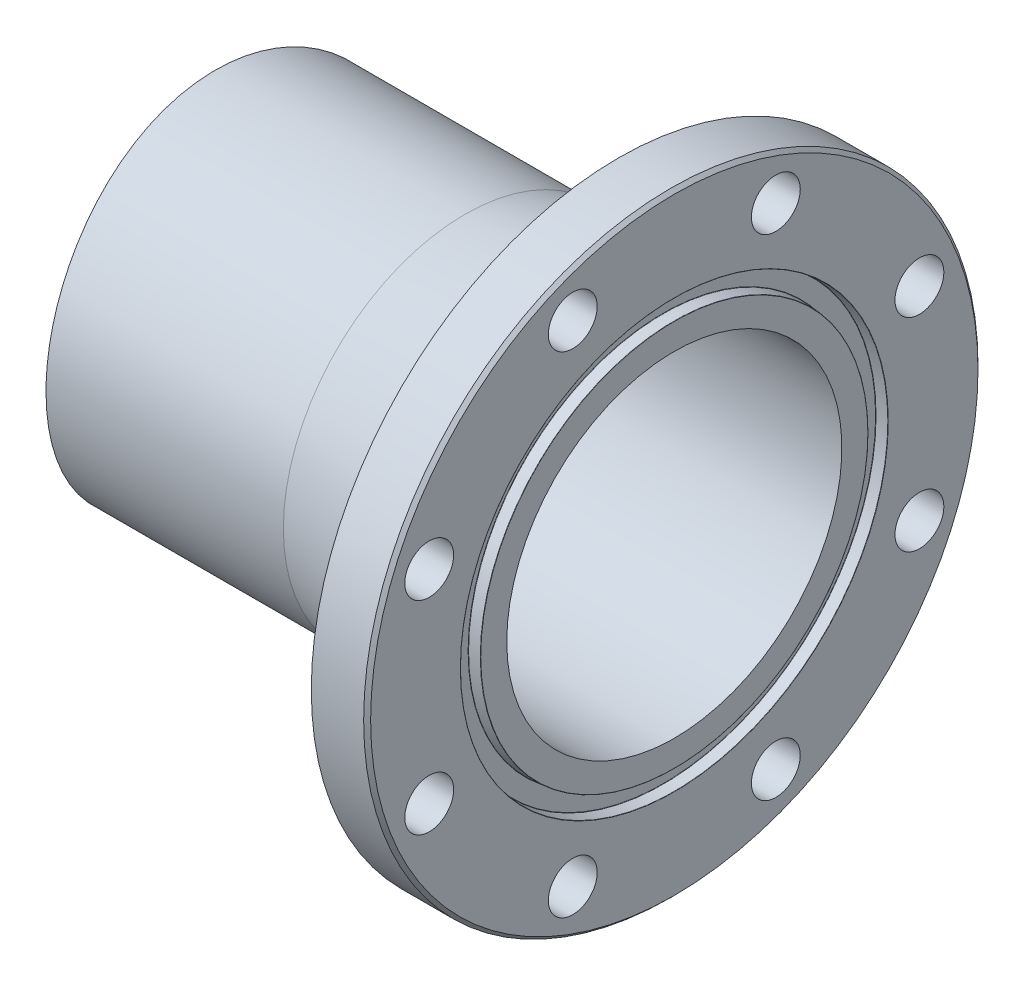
ISO-10303-21;
HEADER;
FILE_DESCRIPTION(('STEP AP214'),'2;1');
FILE_NAME('part.step','',(''),(''),'','','');
FILE_SCHEMA(('AUTOMOTIVE_DESIGN { 1 0 10303 214 1 1 1 1 }'));
ENDSEC;
DATA;
#1=APPLICATION_CONTEXT('core data for automotive mechanical design processes');
#2=APPLICATION_PROTOCOL_DEFINITION('international standard','automotive_design',2000,#1);
#3=PRODUCT_CONTEXT('',#1,'mechanical');
#4=PRODUCT('Part','Part','',(#3));
#5=PRODUCT_RELATED_PRODUCT_CATEGORY('part','',(#4));
#6=PRODUCT_DEFINITION_FORMATION('','',#4);
#7=PRODUCT_DEFINITION_CONTEXT('part definition',#1,'design');
#8=PRODUCT_DEFINITION('design','',#6,#7);
#9=PRODUCT_DEFINITION_SHAPE('','',#8);
#10=(LENGTH_UNIT() NAMED_UNIT(*) SI_UNIT(.MILLI.,.METRE.));
#11=(NAMED_UNIT(*) PLANE_ANGLE_UNIT() SI_UNIT($,.RADIAN.));
#12=(NAMED_UNIT(*) SI_UNIT($,.STERADIAN.) SOLID_ANGLE_UNIT());
#13=UNCERTAINTY_MEASURE_WITH_UNIT(LENGTH_MEASURE(1.E-05),#10,'distance_accuracy_value','');
#14=(GEOMETRIC_REPRESENTATION_CONTEXT(3) GLOBAL_UNCERTAINTY_ASSIGNED_CONTEXT((#13)) GLOBAL_UNIT_ASSIGNED_CONTEXT((#10,
#11,#12)) REPRESENTATION_CONTEXT('',''));
#15=CARTESIAN_POINT('',(0.,0.,0.));
#16=DIRECTION('',(0.,0.,1.));
#17=DIRECTION('',(1.,0.,0.));
#18=AXIS2_PLACEMENT_3D('',#15,#16,#17);
#19=CARTESIAN_POINT('',(0.,0.,0.));
#20=DIRECTION('',(-1.,0.,0.));
#21=DIRECTION('',(0.,0.,1.));
#22=AXIS2_PLACEMENT_3D('',#19,#20,#21);
#23=CYLINDRICAL_SURFACE('',#22,76.2);
#24=CARTESIAN_POINT('',(44.45,0.,76.2));
#25=CARTESIAN_POINT('',(44.450000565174,1.06594364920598,76.2000018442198));
#26=CARTESIAN_POINT('',(44.4472027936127,2.13183889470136,76.1776313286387));
#27=CARTESIAN_POINT('',(44.4360334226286,4.26163663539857,76.0882002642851));
#28=CARTESIAN_POINT('',(44.4276624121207,5.32553932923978,76.0211444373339));
#29=CARTESIAN_POINT('',(44.405402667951,7.4498130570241,75.8424468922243));
#30=CARTESIAN_POINT('',(44.3915124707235,8.51018307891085,75.7307933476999));
#31=CARTESIAN_POINT('',(44.3583122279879,10.6252526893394,75.4631056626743));
#32=CARTESIAN_POINT('',(44.3390020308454,11.6799521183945,75.3070702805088));
#33=CARTESIAN_POINT('',(44.2950785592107,13.7827103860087,74.9507508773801));
#34=CARTESIAN_POINT('',(44.2704605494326,14.8307624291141,74.7504273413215));
#35=CARTESIAN_POINT('',(44.2161030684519,16.9175027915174,74.3059635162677));
#36=CARTESIAN_POINT('',(44.1863631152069,17.9561902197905,74.0618191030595));
#37=CARTESIAN_POINT('',(44.1219781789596,20.0221000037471,73.5302181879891));
#38=CARTESIAN_POINT('',(44.0873339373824,21.0493240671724,73.2427682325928));
#39=CARTESIAN_POINT('',(44.0133778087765,23.0907440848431,72.6250293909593));
#40=CARTESIAN_POINT('',(43.9740654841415,24.1049388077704,72.2947364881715));
#41=CARTESIAN_POINT('',(43.8910839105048,26.1176537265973,71.5922024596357));
#42=CARTESIAN_POINT('',(43.8474179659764,27.1161851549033,71.2199931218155));
#43=CARTESIAN_POINT('',(43.7560068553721,29.09669422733,70.4340650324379));
#44=CARTESIAN_POINT('',(43.7082613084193,30.0786703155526,70.0203424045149));
#45=CARTESIAN_POINT('',(43.6090334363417,32.0241761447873,69.1521996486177));
#46=CARTESIAN_POINT('',(43.5575514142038,32.9877073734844,68.6977828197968));
#47=CARTESIAN_POINT('',(43.4512028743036,34.8948141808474,67.7489953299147));
#48=CARTESIAN_POINT('',(43.3963360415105,35.8383878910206,67.2546209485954));
#49=CARTESIAN_POINT('',(43.2836217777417,37.7035883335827,66.226979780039));
#50=CARTESIAN_POINT('',(43.2257751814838,38.6252211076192,65.6937238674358));
#51=CARTESIAN_POINT('',(43.107486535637,40.4452947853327,64.5890973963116));
#52=CARTESIAN_POINT('',(43.0470442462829,41.3437335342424,64.0177233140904));
#53=CARTESIAN_POINT('',(42.9239953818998,43.1157133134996,62.8379499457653));
#54=CARTESIAN_POINT('',(42.8613890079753,43.9892566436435,62.2295540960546));
#55=CARTESIAN_POINT('',(42.7344438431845,45.7100390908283,60.9767620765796));
#56=CARTESIAN_POINT('',(42.6701048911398,46.5572757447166,60.33236255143));
#57=CARTESIAN_POINT('',(42.4745323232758,49.065335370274,58.340414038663));
#58=CARTESIAN_POINT('',(42.3413232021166,50.6842416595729,56.939617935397));
#59=CARTESIAN_POINT('',(42.0734796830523,53.7982336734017,54.0070915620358));
#60=CARTESIAN_POINT('',(41.9388452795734,55.2933189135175,52.4753607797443));
#61=CARTESIAN_POINT('',(41.6719186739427,58.1496057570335,49.2913471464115));
#62=CARTESIAN_POINT('',(41.5396265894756,59.5108006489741,47.6390582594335));
#63=CARTESIAN_POINT('',(41.2811366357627,62.0895851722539,44.2255495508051));
#64=CARTESIAN_POINT('',(41.1549387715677,63.3071746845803,42.4643296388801));
#65=CARTESIAN_POINT('',(40.911807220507,65.5940015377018,38.8390947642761));
#66=CARTESIAN_POINT('',(40.7949062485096,66.6627241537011,36.9747528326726));
#67=CARTESIAN_POINT('',(40.5742007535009,68.6392164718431,33.1618628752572));
#68=CARTESIAN_POINT('',(40.4703962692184,69.5469856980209,31.213314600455));
#69=CARTESIAN_POINT('',(40.2788832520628,71.1949148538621,27.2458799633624));
#70=CARTESIAN_POINT('',(40.1911742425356,71.935079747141,25.2269956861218));
#71=CARTESIAN_POINT('',(40.034394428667,73.2423551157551,21.133250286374));
#72=CARTESIAN_POINT('',(39.9653235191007,73.8094665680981,19.0583894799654));
#73=CARTESIAN_POINT('',(39.8481409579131,74.7638927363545,14.878567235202));
#74=CARTESIAN_POINT('',(39.799921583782,75.1521322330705,12.7738199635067));
#75=CARTESIAN_POINT('',(39.7253160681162,75.7502678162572,8.53875049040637));
#76=CARTESIAN_POINT('',(39.6989298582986,75.9601644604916,6.40842836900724));
#77=CARTESIAN_POINT('',(39.668757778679,76.2000323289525,2.13759485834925));
#78=CARTESIAN_POINT('',(39.6649711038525,76.2300099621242,-0.00291616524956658));
#79=CARTESIAN_POINT('',(39.6801061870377,76.10983048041,-4.27879073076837));
#80=CARTESIAN_POINT('',(39.6990278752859,75.9596739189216,-6.4141542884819));
#81=CARTESIAN_POINT('',(39.758857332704,75.481731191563,-10.6522151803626));
#82=CARTESIAN_POINT('',(39.7996387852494,75.1549654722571,-12.7550294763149));
#83=CARTESIAN_POINT('',(39.9019367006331,74.3268973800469,-16.9254805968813));
#84=CARTESIAN_POINT('',(39.9634530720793,73.8255957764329,-18.9931175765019));
#85=CARTESIAN_POINT('',(40.1054642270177,72.6521296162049,-23.0786777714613));
#86=CARTESIAN_POINT('',(40.1859592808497,71.979962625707,-25.0966002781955));
#87=CARTESIAN_POINT('',(40.3636380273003,70.4696519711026,-29.0685850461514));
#88=CARTESIAN_POINT('',(40.4608217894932,69.6315076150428,-31.0226470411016));
#89=CARTESIAN_POINT('',(40.6694159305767,67.7927229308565,-34.8586165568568));
#90=CARTESIAN_POINT('',(40.7808648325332,66.7916405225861,-36.740310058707));
#91=CARTESIAN_POINT('',(41.0146250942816,64.6357664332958,-40.4127631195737));
#92=CARTESIAN_POINT('',(41.1369364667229,63.4809745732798,-42.2035225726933));
#93=CARTESIAN_POINT('',(41.3889831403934,61.0257671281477,-45.6818076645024));
#94=CARTESIAN_POINT('',(41.5187187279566,59.7253459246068,-47.3693293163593));
#95=CARTESIAN_POINT('',(41.7819729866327,56.9879826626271,-50.6294407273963));
#96=CARTESIAN_POINT('',(41.9154916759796,55.5510399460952,-52.2020299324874));
#97=CARTESIAN_POINT('',(42.1835062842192,52.5401893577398,-55.2318863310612));
#98=CARTESIAN_POINT('',(42.3180025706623,50.9654023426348,-56.6882800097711));
#99=CARTESIAN_POINT('',(42.5832457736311,47.6985020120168,-59.463319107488));
#100=CARTESIAN_POINT('',(42.7139926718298,46.0063881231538,-60.781963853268));
#101=CARTESIAN_POINT('',(42.9680432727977,42.5166498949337,-63.2721845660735));
#102=CARTESIAN_POINT('',(43.091346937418,40.7190250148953,-64.443759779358));
#103=CARTESIAN_POINT('',(43.3270240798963,37.0308664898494,-66.631464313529));
#104=CARTESIAN_POINT('',(43.439397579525,35.1403330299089,-67.6475939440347));
#105=CARTESIAN_POINT('',(43.6500687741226,31.2789955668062,-69.5173898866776));
#106=CARTESIAN_POINT('',(43.7483616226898,29.3081642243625,-70.371000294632));
#107=CARTESIAN_POINT('',(43.9280338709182,25.3008095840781,-71.9090755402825));
#108=CARTESIAN_POINT('',(44.0094132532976,23.2642862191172,-72.5935402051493));
#109=CARTESIAN_POINT('',(44.1529382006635,19.1401721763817,-73.7882274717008));
#110=CARTESIAN_POINT('',(44.2150845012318,17.0525834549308,-74.2984567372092));
#111=CARTESIAN_POINT('',(44.3183729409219,12.8412791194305,-75.1408854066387));
#112=CARTESIAN_POINT('',(44.3595152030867,10.7175637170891,-75.473085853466));
#113=CARTESIAN_POINT('',(44.4194186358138,6.46362581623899,-75.9553359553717));
#114=CARTESIAN_POINT('',(44.4383275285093,4.33354163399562,-76.1065879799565));
#115=CARTESIAN_POINT('',(44.4537268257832,0.0681170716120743,-76.229833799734));
#116=CARTESIAN_POINT('',(44.4502173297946,-2.06722328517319,-76.2018283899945));
#117=CARTESIAN_POINT('',(44.4208794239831,-6.32782527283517,-75.9667727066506));
#118=CARTESIAN_POINT('',(44.3950514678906,-8.45308710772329,-75.7597260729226));
#119=CARTESIAN_POINT('',(44.3218069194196,-12.6783815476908,-75.1681409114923));
#120=CARTESIAN_POINT('',(44.2743903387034,-14.7784141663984,-74.7836024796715));
#121=CARTESIAN_POINT('',(44.1594962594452,-18.9314316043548,-73.8414504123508));
#122=CARTESIAN_POINT('',(44.0920853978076,-20.9845486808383,-73.2844114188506));
#123=CARTESIAN_POINT('',(43.9390315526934,-25.0364190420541,-72.0009303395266));
#124=CARTESIAN_POINT('',(43.853388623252,-27.0351724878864,-71.2744887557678));
#125=CARTESIAN_POINT('',(43.666256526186,-30.9644127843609,-69.6574384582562));
#126=CARTESIAN_POINT('',(43.5647669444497,-32.8948978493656,-68.7668254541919));
#127=CARTESIAN_POINT('',(43.3487661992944,-36.6741666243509,-66.8278103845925));
#128=CARTESIAN_POINT('',(43.2342549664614,-38.5229498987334,-65.7794074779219));
#129=CARTESIAN_POINT('',(42.9947733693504,-42.1353621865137,-63.5264191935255));
#130=CARTESIAN_POINT('',(42.8697521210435,-43.8985029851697,-62.3210563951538));
#131=CARTESIAN_POINT('',(42.6132662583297,-47.3171328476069,-59.7668946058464));
#132=CARTESIAN_POINT('',(42.4818016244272,-48.9726215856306,-58.4180951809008));
#133=CARTESIAN_POINT('',(42.2161053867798,-52.1645424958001,-55.5864399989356));
#134=CARTESIAN_POINT('',(42.0818736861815,-53.7009704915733,-54.1035795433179));
#135=CARTESIAN_POINT('',(41.8144100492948,-56.64405460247,-51.0141422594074));
#136=CARTESIAN_POINT('',(41.6811781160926,-58.0507103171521,-49.4075650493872));
#137=CARTESIAN_POINT('',(41.4187105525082,-60.7320756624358,-46.0723276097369));
#138=CARTESIAN_POINT('',(41.2895020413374,-62.0059871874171,-44.3430234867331));
#139=CARTESIAN_POINT('',(41.0395669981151,-64.4035888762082,-40.7826429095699));
#140=CARTESIAN_POINT('',(40.9188405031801,-65.5272783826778,-38.9515660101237));
#141=CARTESIAN_POINT('',(40.6893303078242,-67.6163490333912,-35.2005376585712));
#142=CARTESIAN_POINT('',(40.5805464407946,-68.5817323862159,-33.2805874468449));
#143=CARTESIAN_POINT('',(40.3780531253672,-70.3471882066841,-29.3653623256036));
#144=CARTESIAN_POINT('',(40.2843436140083,-71.1472613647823,-27.370087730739));
#145=CARTESIAN_POINT('',(40.1149346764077,-72.5743359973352,-23.3237233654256));
#146=CARTESIAN_POINT('',(40.0391886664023,-73.2017858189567,-21.2727936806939));
#147=CARTESIAN_POINT('',(39.9075841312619,-74.2817350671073,-17.1247461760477));
#148=CARTESIAN_POINT('',(39.8517255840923,-74.7342346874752,-15.0276284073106));
#149=CARTESIAN_POINT('',(39.7615222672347,-75.4608806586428,-10.8023411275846));
#150=CARTESIAN_POINT('',(39.7271766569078,-75.7350339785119,-8.67417283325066));
#151=CARTESIAN_POINT('',(39.6809980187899,-76.1029458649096,-4.40206045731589));
#152=CARTESIAN_POINT('',(39.669164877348,-76.1967053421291,-2.25811645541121));
#153=CARTESIAN_POINT('',(39.6683588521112,-76.2031017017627,2.01514826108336));
#154=CARTESIAN_POINT('',(39.6792278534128,-76.1169913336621,4.14446717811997));
#155=CARTESIAN_POINT('',(39.7231931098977,-75.7668218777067,8.38818155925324));
#156=CARTESIAN_POINT('',(39.7562892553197,-75.5027636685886,10.502577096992));
#157=CARTESIAN_POINT('',(39.8437564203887,-74.7986650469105,14.7014012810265));
#158=CARTESIAN_POINT('',(39.8981273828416,-74.3586251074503,16.7858300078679));
#159=CARTESIAN_POINT('',(40.0265846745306,-73.3058131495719,20.9099744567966));
#160=CARTESIAN_POINT('',(40.1006710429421,-72.693040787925,22.9496900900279));
#161=CARTESIAN_POINT('',(40.2664126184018,-71.2995025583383,26.9693189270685));
#162=CARTESIAN_POINT('',(40.3580613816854,-70.5187982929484,28.9492537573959));
#163=CARTESIAN_POINT('',(40.5563427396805,-68.7949025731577,32.8362846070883));
#164=CARTESIAN_POINT('',(40.6629753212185,-67.8517112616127,34.74338069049));
#165=CARTESIAN_POINT('',(40.8882129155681,-65.8095679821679,38.4715251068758));
#166=CARTESIAN_POINT('',(41.0068179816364,-64.7106153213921,40.2925730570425));
#167=CARTESIAN_POINT('',(41.2526697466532,-62.3646722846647,43.83608603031));
#168=CARTESIAN_POINT('',(41.3799164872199,-61.1176811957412,45.5585505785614));
#169=CARTESIAN_POINT('',(41.6403543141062,-58.475631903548,48.9041387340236));
#170=CARTESIAN_POINT('',(41.7735794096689,-57.0796409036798,50.5265224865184));
#171=CARTESIAN_POINT('',(42.0414361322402,-54.15600552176,53.6482871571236));
#172=CARTESIAN_POINT('',(42.1760677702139,-52.6283601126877,55.1476671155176));
#173=CARTESIAN_POINT('',(42.3761980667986,-50.246538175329,57.2963403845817));
#174=CARTESIAN_POINT('',(42.44262192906,-49.4373217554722,57.9959968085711));
#175=CARTESIAN_POINT('',(42.5743998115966,-47.7901263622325,59.3606533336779));
#176=CARTESIAN_POINT('',(42.6397539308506,-46.9521500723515,60.0256566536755));
#177=CARTESIAN_POINT('',(42.7689372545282,-45.2488161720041,61.3198905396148));
#178=CARTESIAN_POINT('',(42.8327663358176,-44.3834563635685,61.9491182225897));
#179=CARTESIAN_POINT('',(42.9584398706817,-42.6269923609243,63.1705917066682));
#180=CARTESIAN_POINT('',(43.0202845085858,-41.7358905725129,63.7628409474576));
#181=CARTESIAN_POINT('',(43.141794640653,-39.9259120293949,64.9115932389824));
#182=CARTESIAN_POINT('',(43.2014507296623,-39.0069407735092,65.4679483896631));
#183=CARTESIAN_POINT('',(43.3178996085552,-37.1462511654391,66.5413367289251));
#184=CARTESIAN_POINT('',(43.3746926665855,-36.2045349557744,67.0583736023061));
#185=CARTESIAN_POINT('',(43.4850259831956,-34.2997861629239,68.0523243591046));
#186=CARTESIAN_POINT('',(43.5385657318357,-33.3367502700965,68.5292319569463));
#187=CARTESIAN_POINT('',(43.6419963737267,-31.391303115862,69.4419212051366));
#188=CARTESIAN_POINT('',(43.691887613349,-30.4088937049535,69.877706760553));
#189=CARTESIAN_POINT('',(43.7876277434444,-28.4272514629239,70.7070293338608));
#190=CARTESIAN_POINT('',(43.8334802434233,-27.4280346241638,71.1006041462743));
#191=CARTESIAN_POINT('',(43.9208623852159,-25.4137897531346,71.8451953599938));
#192=CARTESIAN_POINT('',(43.9623924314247,-24.3987632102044,72.1962157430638));
#193=CARTESIAN_POINT('',(44.040832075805,-22.3547730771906,72.8550401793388));
#194=CARTESIAN_POINT('',(44.0777423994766,-21.3258117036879,73.1628510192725));
#195=CARTESIAN_POINT('',(44.1466840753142,-19.255736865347,73.7347252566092));
#196=CARTESIAN_POINT('',(44.1787157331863,-18.2146241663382,73.9987913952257));
#197=CARTESIAN_POINT('',(44.2478001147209,-15.7625503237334,74.5658325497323));
#198=CARTESIAN_POINT('',(44.2827986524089,-14.3473779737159,74.8510197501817));
#199=CARTESIAN_POINT('',(44.343115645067,-11.5032594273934,75.3405397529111));
#200=CARTESIAN_POINT('',(44.3684361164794,-10.0743161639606,75.5448893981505));
#201=CARTESIAN_POINT('',(44.4090836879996,-7.20690797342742,75.8721482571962));
#202=CARTESIAN_POINT('',(44.4244102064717,-5.76844249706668,75.9950527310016));
#203=CARTESIAN_POINT('',(44.4448683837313,-2.88662202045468,76.1589805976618));
#204=CARTESIAN_POINT('',(44.4499992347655,-1.44326664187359,76.1999975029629));
#205=CARTESIAN_POINT('',(44.45,0.,76.2));
#206=B_SPLINE_CURVE_WITH_KNOTS('',3,(#24,#25,#26,#27,#28,#29,#30,#31,#32,#33,#34,#35,#36,#37,
#38,#39,#40,#41,#42,#43,#44,#45,#46,#47,#48,#49,#50,#51,#52,#53,#54,#55,#56,#57,#58,#59,#60,#61,
#62,#63,#64,#65,#66,#67,#68,#69,#70,#71,#72,#73,#74,#75,#76,#77,#78,#79,#80,#81,#82,#83,#84,#85,
#86,#87,#88,#89,#90,#91,#92,#93,#94,#95,#96,#97,#98,#99,#100,#101,#102,#103,#104,#105,#106,#107,
#108,#109,#110,#111,#112,#113,#114,#115,#116,#117,#118,#119,#120,#121,#122,#123,#124,#125,#126,
#127,#128,#129,#130,#131,#132,#133,#134,#135,#136,#137,#138,#139,#140,#141,#142,#143,#144,#145,
#146,#147,#148,#149,#150,#151,#152,#153,#154,#155,#156,#157,#158,#159,#160,#161,#162,#163,#164,
#165,#166,#167,#168,#169,#170,#171,#172,#173,#174,#175,#176,#177,#178,#179,#180,#181,#182,#183,
#184,#185,#186,#187,#188,#189,#190,#191,#192,#193,#194,#195,#196,#197,#198,#199,#200,#201,#202,
#203,#204,#205),.UNSPECIFIED.,.T.,.F.,(4,2,2,2,2,2,2,2,2,2,2,2,2,2,2,2,2,2,2,2,2,2,2,2,2,2,2,2,
2,2,2,2,2,2,2,2,2,2,2,2,2,2,2,2,2,2,2,2,2,2,2,2,2,2,2,2,2,2,2,2,2,2,2,2,2,2,2,2,2,2,2,2,2,2,2,2,
2,2,2,2,2,2,2,2,2,2,2,2,2,2,4),(0.,3.19750885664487,6.3946798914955,9.59269931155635,
12.7908082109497,15.9917821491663,19.1930575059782,22.3938494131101,25.5949416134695,
28.7936223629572,31.9926020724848,35.1913226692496,38.3903414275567,41.5884688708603,
44.7868923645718,47.9850194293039,51.1834450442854,57.6100445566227,64.0366692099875,
70.4636158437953,76.8905678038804,83.3392175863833,89.7878864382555,96.2363642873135,
102.684805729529,109.09952345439,115.514221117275,121.928690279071,128.343139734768,
134.720916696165,141.098665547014,147.476505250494,153.854371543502,160.249839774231,
166.645315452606,173.041037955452,179.436791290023,185.876811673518,192.316863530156,
198.756948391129,205.19702042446,211.639303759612,218.081593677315,224.523637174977,
230.965642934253,237.364600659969,243.763530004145,250.16232926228,256.561125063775,
262.938830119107,269.316516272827,275.694369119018,282.072255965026,288.483027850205,
294.893819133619,301.304835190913,307.715871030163,314.163463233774,320.611083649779,
327.058614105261,333.506117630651,339.936713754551,346.36730275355,352.797640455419,
359.227945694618,365.613614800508,371.999252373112,378.384872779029,384.770505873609,
391.153800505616,397.53708952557,403.920406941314,410.303755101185,416.729712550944,
423.155720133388,426.370355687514,429.584692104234,432.799287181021,436.01358279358,
439.240372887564,442.466860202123,445.693851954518,448.920536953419,452.144308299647,
455.367777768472,458.590740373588,461.813500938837,466.143172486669,470.47194144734,
474.800962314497,479.130326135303),.UNSPECIFIED.);
#207=CARTESIAN_POINT('',(44.45,0.,76.2));
#208=VERTEX_POINT('',#207);
#209=EDGE_CURVE('E73',#208,#208,#206,.T.);
#210=ORIENTED_EDGE('',*,*,#209,.T.);
#211=EDGE_LOOP('',(#210));
#212=FACE_BOUND('',#211,.T.);
#213=CARTESIAN_POINT('',(247.65,0.,0.));
#214=DIRECTION('',(-1.,0.,0.));
#215=DIRECTION('',(0.,0.,1.));
#216=AXIS2_PLACEMENT_3D('',#213,#214,#215);
#217=CIRCLE('',#216,76.2);
#218=CARTESIAN_POINT('',(247.65,0.,76.2));
#219=VERTEX_POINT('',#218);
#220=EDGE_CURVE('E51',#219,#219,#217,.T.);
#221=ORIENTED_EDGE('',*,*,#220,.F.);
#222=EDGE_LOOP('',(#221));
#223=FACE_BOUND('',#222,.T.);
#224=ADVANCED_FACE('F31',(#212,#223),#23,.F.);
#225=CARTESIAN_POINT('',(247.65,0.,-76.2));
#226=DIRECTION('',(-1.,0.,0.));
#227=DIRECTION('',(0.,0.,1.));
#228=AXIS2_PLACEMENT_3D('',#225,#226,#227);
#229=PLANE('',#228);
#230=CARTESIAN_POINT('',(247.65,0.,0.));
#231=DIRECTION('',(-1.,0.,0.));
#232=DIRECTION('',(0.,0.,1.));
#233=AXIS2_PLACEMENT_3D('',#230,#231,#232);
#234=CIRCLE('',#233,88.0194613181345);
#235=CARTESIAN_POINT('',(247.65,0.,88.0194613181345));
#236=VERTEX_POINT('',#235);
#237=EDGE_CURVE('E151',#236,#236,#234,.T.);
#238=ORIENTED_EDGE('',*,*,#237,.F.);
#239=EDGE_LOOP('',(#238));
#240=FACE_BOUND('',#239,.T.);
#241=ORIENTED_EDGE('',*,*,#220,.T.);
#242=EDGE_LOOP('',(#241));
#243=FACE_BOUND('',#242,.T.);
#244=ADVANCED_FACE('F100',(#240,#243),#229,.F.);
#245=CARTESIAN_POINT('',(247.523,0.,0.));
#246=DIRECTION('',(-1.,0.,0.));
#247=DIRECTION('',(0.,0.,1.));
#248=AXIS2_PLACEMENT_3D('',#245,#246,#247);
#249=TOROIDAL_SURFACE('',#248,88.0194613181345,0.126999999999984);
#250=CARTESIAN_POINT('',(247.534068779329,0.,0.));
#251=DIRECTION('',(-1.,0.,0.));
#252=DIRECTION('',(0.,0.,1.));
#253=AXIS2_PLACEMENT_3D('',#250,#251,#252);
#254=CIRCLE('',#253,88.1459780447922);
#255=CARTESIAN_POINT('',(247.534068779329,0.,88.1459780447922));
#256=VERTEX_POINT('',#255);
#257=EDGE_CURVE('E149',#256,#256,#254,.T.);
#258=ORIENTED_EDGE('',*,*,#257,.F.);
#259=EDGE_LOOP('',(#258));
#260=FACE_BOUND('',#259,.T.);
#261=ORIENTED_EDGE('',*,*,#237,.T.);
#262=EDGE_LOOP('',(#261));
#263=FACE_BOUND('',#262,.T.);
#264=ADVANCED_FACE('F160',(#260,#263),#249,.T.);
#265=CARTESIAN_POINT('',(247.534068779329,0.,0.));
#266=DIRECTION('',(-1.,0.,0.));
#267=DIRECTION('',(0.,0.,1.));
#268=AXIS2_PLACEMENT_3D('',#265,#266,#267);
#269=CONICAL_SURFACE('',#268,88.1459780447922,0.0872664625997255);
#270=CARTESIAN_POINT('',(242.660531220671,0.,0.));
#271=DIRECTION('',(-1.,0.,0.));
#272=DIRECTION('',(0.,0.,1.));
#273=AXIS2_PLACEMENT_3D('',#270,#271,#272);
#274=CIRCLE('',#273,88.5723573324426);
#275=CARTESIAN_POINT('',(242.660531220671,0.,88.5723573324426));
#276=VERTEX_POINT('',#275);
#277=EDGE_CURVE('E146',#276,#276,#274,.T.);
#278=ORIENTED_EDGE('',*,*,#277,.F.);
#279=EDGE_LOOP('',(#278));
#280=FACE_BOUND('',#279,.T.);
#281=ORIENTED_EDGE('',*,*,#257,.T.);
#282=EDGE_LOOP('',(#281));
#283=FACE_BOUND('',#282,.T.);
#284=ADVANCED_FACE('F165',(#280,#283),#269,.T.);
#285=CARTESIAN_POINT('',(242.6716,0.,0.));
#286=DIRECTION('',(-1.,0.,0.));
#287=DIRECTION('',(0.,0.,1.));
#288=AXIS2_PLACEMENT_3D('',#285,#286,#287);
#289=TOROIDAL_SURFACE('',#288,88.6988740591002,0.12699999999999);
#290=CARTESIAN_POINT('',(242.5446,0.,0.));
#291=DIRECTION('',(-1.,0.,0.));
#292=DIRECTION('',(0.,0.,1.));
#293=AXIS2_PLACEMENT_3D('',#290,#291,#292);
#294=CIRCLE('',#293,88.6988740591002);
#295=CARTESIAN_POINT('',(242.5446,0.,88.6988740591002));
#296=VERTEX_POINT('',#295);
#297=EDGE_CURVE('E143',#296,#296,#294,.T.);
#298=ORIENTED_EDGE('',*,*,#297,.F.);
#299=EDGE_LOOP('',(#298));
#300=FACE_BOUND('',#299,.T.);
#301=ORIENTED_EDGE('',*,*,#277,.T.);
#302=EDGE_LOOP('',(#301));
#303=FACE_BOUND('',#302,.T.);
#304=ADVANCED_FACE('F170',(#300,#303),#289,.F.);
#305=CARTESIAN_POINT('',(242.5446,0.,-88.6988740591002));
#306=DIRECTION('',(-1.,0.,0.));
#307=DIRECTION('',(0.,0.,1.));
#308=AXIS2_PLACEMENT_3D('',#305,#306,#307);
#309=PLANE('',#308);
#310=CARTESIAN_POINT('',(242.5446,0.,0.));
#311=DIRECTION('',(-1.,0.,0.));
#312=DIRECTION('',(0.,0.,1.));
#313=AXIS2_PLACEMENT_3D('',#310,#311,#312);
#314=CIRCLE('',#313,96.6449259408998);
#315=CARTESIAN_POINT('',(242.5446,0.,96.6449259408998));
#316=VERTEX_POINT('',#315);
#317=EDGE_CURVE('E140',#316,#316,#314,.T.);
#318=ORIENTED_EDGE('',*,*,#317,.F.);
#319=EDGE_LOOP('',(#318));
#320=FACE_BOUND('',#319,.T.);
#321=ORIENTED_EDGE('',*,*,#297,.T.);
#322=EDGE_LOOP('',(#321));
#323=FACE_BOUND('',#322,.T.);
#324=ADVANCED_FACE('F177',(#320,#323),#309,.F.);
#325=CARTESIAN_POINT('',(242.6716,0.,0.));
#326=DIRECTION('',(-1.,0.,0.));
#327=DIRECTION('',(0.,0.,1.));
#328=AXIS2_PLACEMENT_3D('',#325,#326,#327);
#329=TOROIDAL_SURFACE('',#328,96.6449259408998,0.12699999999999);
#330=CARTESIAN_POINT('',(242.660531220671,0.,0.));
#331=DIRECTION('',(-1.,0.,0.));
#332=DIRECTION('',(0.,0.,1.));
#333=AXIS2_PLACEMENT_3D('',#330,#331,#332);
#334=CIRCLE('',#333,96.7714426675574);
#335=CARTESIAN_POINT('',(242.660531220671,0.,96.7714426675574));
#336=VERTEX_POINT('',#335);
#337=EDGE_CURVE('E137',#336,#336,#334,.T.);
#338=ORIENTED_EDGE('',*,*,#337,.F.);
#339=EDGE_LOOP('',(#338));
#340=FACE_BOUND('',#339,.T.);
#341=ORIENTED_EDGE('',*,*,#317,.T.);
#342=EDGE_LOOP('',(#341));
#343=FACE_BOUND('',#342,.T.);
#344=ADVANCED_FACE('F181',(#340,#343),#329,.F.);
#345=CARTESIAN_POINT('',(242.660531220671,0.,0.));
#346=DIRECTION('',(1.,0.,0.));
#347=DIRECTION('',(0.,0.,-1.));
#348=AXIS2_PLACEMENT_3D('',#345,#346,#347);
#349=CONICAL_SURFACE('',#348,96.7714426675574,0.0872664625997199);
#350=CARTESIAN_POINT('',(247.534068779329,0.,0.));
#351=DIRECTION('',(-1.,0.,0.));
#352=DIRECTION('',(0.,0.,1.));
#353=AXIS2_PLACEMENT_3D('',#350,#351,#352);
#354=CIRCLE('',#353,97.1978219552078);
#355=CARTESIAN_POINT('',(247.534068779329,0.,97.1978219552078));
#356=VERTEX_POINT('',#355);
#357=EDGE_CURVE('E131',#356,#356,#354,.T.);
#358=ORIENTED_EDGE('',*,*,#357,.F.);
#359=EDGE_LOOP('',(#358));
#360=FACE_BOUND('',#359,.T.);
#361=ORIENTED_EDGE('',*,*,#337,.T.);
#362=EDGE_LOOP('',(#361));
#363=FACE_BOUND('',#362,.T.);
#364=ADVANCED_FACE('F185',(#360,#363),#349,.F.);
#365=CARTESIAN_POINT('',(247.523,0.,0.));
#366=DIRECTION('',(-1.,0.,0.));
#367=DIRECTION('',(0.,0.,1.));
#368=AXIS2_PLACEMENT_3D('',#365,#366,#367);
#369=TOROIDAL_SURFACE('',#368,97.3243386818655,0.126999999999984);
#370=CARTESIAN_POINT('',(247.65,0.,0.));
#371=DIRECTION('',(-1.,0.,0.));
#372=DIRECTION('',(0.,0.,1.));
#373=AXIS2_PLACEMENT_3D('',#370,#371,#372);
#374=CIRCLE('',#373,97.3243386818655);
#375=CARTESIAN_POINT('',(247.65,0.,97.3243386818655));
#376=VERTEX_POINT('',#375);
#377=EDGE_CURVE('E129',#376,#376,#374,.T.);
#378=ORIENTED_EDGE('',*,*,#377,.F.);
#379=EDGE_LOOP('',(#378));
#380=FACE_BOUND('',#379,.T.);
#381=ORIENTED_EDGE('',*,*,#357,.T.);
#382=EDGE_LOOP('',(#381));
#383=FACE_BOUND('',#382,.T.);
#384=ADVANCED_FACE('F189',(#380,#383),#369,.T.);
#385=CARTESIAN_POINT('',(247.65,0.,-97.3243386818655));
#386=DIRECTION('',(-1.,0.,0.));
#387=DIRECTION('',(0.,0.,1.));
#388=AXIS2_PLACEMENT_3D('',#385,#386,#387);
#389=PLANE('',#388);
#390=CARTESIAN_POINT('',(247.65,0.,0.));
#391=DIRECTION('',(-1.,0.,0.));
#392=DIRECTION('',(0.,0.,1.));
#393=AXIS2_PLACEMENT_3D('',#390,#391,#392);
#394=CIRCLE('',#393,138.1125);
#395=CARTESIAN_POINT('',(247.65,0.,138.1125));
#396=VERTEX_POINT('',#395);
#397=EDGE_CURVE('E42',#396,#396,#394,.F.);
#398=ORIENTED_EDGE('',*,*,#397,.T.);
#399=EDGE_LOOP('',(#398));
#400=FACE_BOUND('',#399,.T.);
#401=CARTESIAN_POINT('',(247.65,111.466065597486,46.1707561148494));
#402=DIRECTION('',(1.,0.,0.));
#403=DIRECTION('',(0.,0.,-1.));
#404=AXIS2_PLACEMENT_3D('',#401,#402,#403);
#405=CIRCLE('',#404,11.1125);
#406=CARTESIAN_POINT('',(247.65,111.466065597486,35.0582561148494));
#407=VERTEX_POINT('',#406);
#408=EDGE_CURVE('E56',#407,#407,#405,.T.);
#409=ORIENTED_EDGE('',*,*,#408,.F.);
#410=EDGE_LOOP('',(#409));
#411=FACE_BOUND('',#410,.T.);
#412=CARTESIAN_POINT('',(247.65,111.466065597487,-46.170756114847));
#413=DIRECTION('',(1.,0.,0.));
#414=DIRECTION('',(0.,0.,-1.));
#415=AXIS2_PLACEMENT_3D('',#412,#413,#414);
#416=CIRCLE('',#415,11.1125);
#417=CARTESIAN_POINT('',(247.65,111.466065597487,-57.283256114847));
#418=VERTEX_POINT('',#417);
#419=EDGE_CURVE('E55',#418,#418,#416,.T.);
#420=ORIENTED_EDGE('',*,*,#419,.F.);
#421=EDGE_LOOP('',(#420));
#422=FACE_BOUND('',#421,.T.);
#423=CARTESIAN_POINT('',(247.65,46.170756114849,-111.466065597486));
#424=DIRECTION('',(1.,0.,0.));
#425=DIRECTION('',(0.,0.,-1.));
#426=AXIS2_PLACEMENT_3D('',#423,#424,#425);
#427=CIRCLE('',#426,11.1125);
#428=CARTESIAN_POINT('',(247.65,46.170756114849,-122.578565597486));
#429=VERTEX_POINT('',#428);
#430=EDGE_CURVE('E60',#429,#429,#427,.T.);
#431=ORIENTED_EDGE('',*,*,#430,.F.);
#432=EDGE_LOOP('',(#431));
#433=FACE_BOUND('',#432,.T.);
#434=CARTESIAN_POINT('',(247.65,-46.1707561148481,-111.466065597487));
#435=DIRECTION('',(1.,0.,0.));
#436=DIRECTION('',(0.,0.,-1.));
#437=AXIS2_PLACEMENT_3D('',#434,#435,#436);
#438=CIRCLE('',#437,11.1125);
#439=CARTESIAN_POINT('',(247.65,-46.1707561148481,-122.578565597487));
#440=VERTEX_POINT('',#439);
#441=EDGE_CURVE('E417',#440,#440,#438,.T.);
#442=ORIENTED_EDGE('',*,*,#441,.F.);
#443=EDGE_LOOP('',(#442));
#444=FACE_BOUND('',#443,.T.);
#445=CARTESIAN_POINT('',(247.65,-111.466065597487,-46.1707561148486));
#446=DIRECTION('',(1.,0.,0.));
#447=DIRECTION('',(0.,0.,-1.));
#448=AXIS2_PLACEMENT_3D('',#445,#446,#447);
#449=CIRCLE('',#448,11.1125);
#450=CARTESIAN_POINT('',(247.65,-111.466065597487,-57.2832561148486));
#451=VERTEX_POINT('',#450);
#452=EDGE_CURVE('E413',#451,#451,#449,.T.);
#453=ORIENTED_EDGE('',*,*,#452,.F.);
#454=EDGE_LOOP('',(#453));
#455=FACE_BOUND('',#454,.T.);
#456=CARTESIAN_POINT('',(247.65,-111.466065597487,46.1707561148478));
#457=DIRECTION('',(1.,0.,0.));
#458=DIRECTION('',(0.,0.,-1.));
#459=AXIS2_PLACEMENT_3D('',#456,#457,#458);
#460=CIRCLE('',#459,11.1125);
#461=CARTESIAN_POINT('',(247.65,-111.466065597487,35.0582561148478));
#462=VERTEX_POINT('',#461);
#463=EDGE_CURVE('E409',#462,#462,#460,.T.);
#464=ORIENTED_EDGE('',*,*,#463,.F.);
#465=EDGE_LOOP('',(#464));
#466=FACE_BOUND('',#465,.T.);
#467=CARTESIAN_POINT('',(247.65,-46.1707561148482,111.466065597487));
#468=DIRECTION('',(1.,0.,0.));
#469=DIRECTION('',(0.,0.,-1.));
#470=AXIS2_PLACEMENT_3D('',#467,#468,#469);
#471=CIRCLE('',#470,11.1125);
#472=CARTESIAN_POINT('',(247.65,-46.1707561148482,100.353565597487));
#473=VERTEX_POINT('',#472);
#474=EDGE_CURVE('E65',#473,#473,#471,.T.);
#475=ORIENTED_EDGE('',*,*,#474,.F.);
#476=EDGE_LOOP('',(#475));
#477=FACE_BOUND('',#476,.T.);
#478=CARTESIAN_POINT('',(247.65,46.1707561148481,111.466065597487));
#479=DIRECTION('',(1.,0.,0.));
#480=DIRECTION('',(0.,0.,-1.));
#481=AXIS2_PLACEMENT_3D('',#478,#479,#480);
#482=CIRCLE('',#481,11.1125);
#483=CARTESIAN_POINT('',(247.65,46.1707561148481,100.353565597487));
#484=VERTEX_POINT('',#483);
#485=EDGE_CURVE('E64',#484,#484,#482,.T.);
#486=ORIENTED_EDGE('',*,*,#485,.F.);
#487=EDGE_LOOP('',(#486));
#488=FACE_BOUND('',#487,.T.);
#489=ORIENTED_EDGE('',*,*,#377,.T.);
#490=EDGE_LOOP('',(#489));
#491=FACE_BOUND('',#490,.T.);
#492=ADVANCED_FACE('F123',(#400,#411,#422,#433,#444,#455,#466,#477,#488,#491),#389,.F.);
#493=CARTESIAN_POINT('',(0.,0.,0.));
#494=DIRECTION('',(-1.,0.,0.));
#495=DIRECTION('',(0.,0.,1.));
#496=AXIS2_PLACEMENT_3D('',#493,#494,#495);
#497=CYLINDRICAL_SURFACE('',#496,139.7);
#498=CARTESIAN_POINT('',(246.0625,0.,0.));
#499=DIRECTION('',(-1.,0.,0.));
#500=DIRECTION('',(0.,0.,1.));
#501=AXIS2_PLACEMENT_3D('',#498,#499,#500);
#502=CIRCLE('',#501,139.7);
#503=CARTESIAN_POINT('',(246.0625,0.,139.7));
#504=VERTEX_POINT('',#503);
#505=EDGE_CURVE('E46',#504,#504,#502,.T.);
#506=ORIENTED_EDGE('',*,*,#505,.T.);
#507=EDGE_LOOP('',(#506));
#508=FACE_BOUND('',#507,.T.);
#509=CARTESIAN_POINT('',(222.25,0.,0.));
#510=DIRECTION('',(-1.,0.,0.));
#511=DIRECTION('',(0.,0.,1.));
#512=AXIS2_PLACEMENT_3D('',#509,#510,#511);
#513=CIRCLE('',#512,139.7);
#514=CARTESIAN_POINT('',(222.25,0.,139.7));
#515=VERTEX_POINT('',#514);
#516=EDGE_CURVE('E127',#515,#515,#513,.T.);
#517=ORIENTED_EDGE('',*,*,#516,.F.);
#518=EDGE_LOOP('',(#517));
#519=FACE_BOUND('',#518,.T.);
#520=ADVANCED_FACE('F119',(#508,#519),#497,.T.);
#521=CARTESIAN_POINT('',(222.25,0.,-139.7));
#522=DIRECTION('',(1.,0.,0.));
#523=DIRECTION('',(0.,0.,-1.));
#524=AXIS2_PLACEMENT_3D('',#521,#522,#523);
#525=PLANE('',#524);
#526=CARTESIAN_POINT('',(222.25,0.,0.));
#527=DIRECTION('',(1.,0.,0.));
#528=DIRECTION('',(0.,0.,-1.));
#529=AXIS2_PLACEMENT_3D('',#526,#527,#528);
#530=CIRCLE('',#529,103.199339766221);
#531=CARTESIAN_POINT('',(222.25,0.,-103.199339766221));
#532=VERTEX_POINT('',#531);
#533=EDGE_CURVE('E10',#532,#532,#530,.T.);
#534=ORIENTED_EDGE('',*,*,#533,.T.);
#535=EDGE_LOOP('',(#534));
#536=FACE_BOUND('',#535,.T.);
#537=CARTESIAN_POINT('',(222.25,111.466065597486,46.1707561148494));
#538=DIRECTION('',(1.,0.,0.));
#539=DIRECTION('',(0.,0.,-1.));
#540=AXIS2_PLACEMENT_3D('',#537,#538,#539);
#541=CIRCLE('',#540,11.1125);
#542=CARTESIAN_POINT('',(222.25,111.466065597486,35.0582561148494));
#543=VERTEX_POINT('',#542);
#544=EDGE_CURVE('E52',#543,#543,#541,.T.);
#545=ORIENTED_EDGE('',*,*,#544,.T.);
#546=EDGE_LOOP('',(#545));
#547=FACE_BOUND('',#546,.T.);
#548=CARTESIAN_POINT('',(222.25,111.466065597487,-46.170756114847));
#549=DIRECTION('',(1.,0.,0.));
#550=DIRECTION('',(0.,0.,-1.));
#551=AXIS2_PLACEMENT_3D('',#548,#549,#550);
#552=CIRCLE('',#551,11.1125);
#553=CARTESIAN_POINT('',(222.25,111.466065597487,-57.283256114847));
#554=VERTEX_POINT('',#553);
#555=EDGE_CURVE('E57',#554,#554,#552,.T.);
#556=ORIENTED_EDGE('',*,*,#555,.T.);
#557=EDGE_LOOP('',(#556));
#558=FACE_BOUND('',#557,.T.);
#559=CARTESIAN_POINT('',(222.25,46.170756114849,-111.466065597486));
#560=DIRECTION('',(1.,0.,0.));
#561=DIRECTION('',(0.,0.,-1.));
#562=AXIS2_PLACEMENT_3D('',#559,#560,#561);
#563=CIRCLE('',#562,11.1125);
#564=CARTESIAN_POINT('',(222.25,46.170756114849,-122.578565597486));
#565=VERTEX_POINT('',#564);
#566=EDGE_CURVE('E385',#565,#565,#563,.T.);
#567=ORIENTED_EDGE('',*,*,#566,.T.);
#568=EDGE_LOOP('',(#567));
#569=FACE_BOUND('',#568,.T.);
#570=CARTESIAN_POINT('',(222.25,-46.1707561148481,-111.466065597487));
#571=DIRECTION('',(1.,0.,0.));
#572=DIRECTION('',(0.,0.,-1.));
#573=AXIS2_PLACEMENT_3D('',#570,#571,#572);
#574=CIRCLE('',#573,11.1125);
#575=CARTESIAN_POINT('',(222.25,-46.1707561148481,-122.578565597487));
#576=VERTEX_POINT('',#575);
#577=EDGE_CURVE('E389',#576,#576,#574,.T.);
#578=ORIENTED_EDGE('',*,*,#577,.T.);
#579=EDGE_LOOP('',(#578));
#580=FACE_BOUND('',#579,.T.);
#581=CARTESIAN_POINT('',(222.25,-111.466065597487,-46.1707561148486));
#582=DIRECTION('',(1.,0.,0.));
#583=DIRECTION('',(0.,0.,-1.));
#584=AXIS2_PLACEMENT_3D('',#581,#582,#583);
#585=CIRCLE('',#584,11.1125);
#586=CARTESIAN_POINT('',(222.25,-111.466065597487,-57.2832561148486));
#587=VERTEX_POINT('',#586);
#588=EDGE_CURVE('E393',#587,#587,#585,.T.);
#589=ORIENTED_EDGE('',*,*,#588,.T.);
#590=EDGE_LOOP('',(#589));
#591=FACE_BOUND('',#590,.T.);
#592=CARTESIAN_POINT('',(222.25,-111.466065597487,46.1707561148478));
#593=DIRECTION('',(1.,0.,0.));
#594=DIRECTION('',(0.,0.,-1.));
#595=AXIS2_PLACEMENT_3D('',#592,#593,#594);
#596=CIRCLE('',#595,11.1125);
#597=CARTESIAN_POINT('',(222.25,-111.466065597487,35.0582561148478));
#598=VERTEX_POINT('',#597);
#599=EDGE_CURVE('E397',#598,#598,#596,.T.);
#600=ORIENTED_EDGE('',*,*,#599,.T.);
#601=EDGE_LOOP('',(#600));
#602=FACE_BOUND('',#601,.T.);
#603=CARTESIAN_POINT('',(222.25,-46.1707561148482,111.466065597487));
#604=DIRECTION('',(1.,0.,0.));
#605=DIRECTION('',(0.,0.,-1.));
#606=AXIS2_PLACEMENT_3D('',#603,#604,#605);
#607=CIRCLE('',#606,11.1125);
#608=CARTESIAN_POINT('',(222.25,-46.1707561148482,100.353565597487));
#609=VERTEX_POINT('',#608);
#610=EDGE_CURVE('E61',#609,#609,#607,.T.);
#611=ORIENTED_EDGE('',*,*,#610,.T.);
#612=EDGE_LOOP('',(#611));
#613=FACE_BOUND('',#612,.T.);
#614=CARTESIAN_POINT('',(222.25,46.1707561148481,111.466065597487));
#615=DIRECTION('',(1.,0.,0.));
#616=DIRECTION('',(0.,0.,-1.));
#617=AXIS2_PLACEMENT_3D('',#614,#615,#616);
#618=CIRCLE('',#617,11.1125);
#619=CARTESIAN_POINT('',(222.25,46.1707561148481,100.353565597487));
#620=VERTEX_POINT('',#619);
#621=EDGE_CURVE('E74',#620,#620,#618,.T.);
#622=ORIENTED_EDGE('',*,*,#621,.T.);
#623=EDGE_LOOP('',(#622));
#624=FACE_BOUND('',#623,.T.);
#625=ORIENTED_EDGE('',*,*,#516,.T.);
#626=EDGE_LOOP('',(#625));
#627=FACE_BOUND('',#626,.T.);
#628=ADVANCED_FACE('F122',(#536,#547,#558,#569,#580,#591,#602,#613,#624,#627),#525,.F.);
#629=CARTESIAN_POINT('',(222.25,0.,0.));
#630=DIRECTION('',(1.,0.,0.));
#631=DIRECTION('',(0.,0.,-1.));
#632=AXIS2_PLACEMENT_3D('',#629,#630,#631);
#633=CONICAL_SURFACE('',#632,95.25,0.179853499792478);
#634=CARTESIAN_POINT('',(214.428883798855,0.,0.));
#635=DIRECTION('',(1.,0.,0.));
#636=DIRECTION('',(0.,0.,-1.));
#637=AXIS2_PLACEMENT_3D('',#634,#635,#636);
#638=CIRCLE('',#637,93.8279788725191);
#639=CARTESIAN_POINT('',(214.428883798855,0.,-93.8279788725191));
#640=VERTEX_POINT('',#639);
#641=EDGE_CURVE('E38',#640,#640,#638,.F.);
#642=ORIENTED_EDGE('',*,*,#641,.T.);
#643=EDGE_LOOP('',(#642));
#644=FACE_BOUND('',#643,.T.);
#645=CARTESIAN_POINT('',(152.4,0.,0.));
#646=DIRECTION('',(-1.,0.,0.));
#647=DIRECTION('',(0.,0.,1.));
#648=AXIS2_PLACEMENT_3D('',#645,#646,#647);
#649=CIRCLE('',#648,82.55);
#650=CARTESIAN_POINT('',(152.4,0.,82.55));
#651=VERTEX_POINT('',#650);
#652=EDGE_CURVE('E94',#651,#651,#649,.T.);
#653=ORIENTED_EDGE('',*,*,#652,.F.);
#654=EDGE_LOOP('',(#653));
#655=FACE_BOUND('',#654,.T.);
#656=ADVANCED_FACE('F198',(#644,#655),#633,.T.);
#657=CARTESIAN_POINT('',(0.,0.,0.));
#658=DIRECTION('',(-1.,0.,0.));
#659=DIRECTION('',(0.,0.,1.));
#660=AXIS2_PLACEMENT_3D('',#657,#658,#659);
#661=CYLINDRICAL_SURFACE('',#660,82.55);
#662=CARTESIAN_POINT('',(44.45,0.,82.55));
#663=CARTESIAN_POINT('',(44.4500007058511,-1.15393578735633,82.5500021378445));
#664=CARTESIAN_POINT('',(44.4467219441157,-2.30781639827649,82.5258024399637));
#665=CARTESIAN_POINT('',(44.4336324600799,-4.61341434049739,82.4290597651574));
#666=CARTESIAN_POINT('',(44.4238224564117,-5.76513189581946,82.3565221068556));
#667=CARTESIAN_POINT('',(44.3977362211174,-8.06473317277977,82.1632178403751));
#668=CARTESIAN_POINT('',(44.3814583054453,-9.21261581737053,82.0424386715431));
#669=CARTESIAN_POINT('',(44.3425508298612,-11.502237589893,81.7528752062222));
#670=CARTESIAN_POINT('',(44.3199210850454,-12.6439765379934,81.5840895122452));
#671=CARTESIAN_POINT('',(44.2684473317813,-14.9202274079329,81.1986634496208));
#672=CARTESIAN_POINT('',(44.2395979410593,-16.0547321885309,80.9819816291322));
#673=CARTESIAN_POINT('',(44.1758971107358,-18.313598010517,80.5012307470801));
#674=CARTESIAN_POINT('',(44.1410451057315,-19.4379580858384,80.2371572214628));
#675=CARTESIAN_POINT('',(44.0655922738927,-21.674262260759,79.6621715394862));
#676=CARTESIAN_POINT('',(44.0249923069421,-22.7862081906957,79.3512663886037));
#677=CARTESIAN_POINT('',(43.9383213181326,-24.9959922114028,78.6831327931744));
#678=CARTESIAN_POINT('',(43.8922497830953,-26.0938289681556,78.3259000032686));
#679=CARTESIAN_POINT('',(43.7950009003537,-28.2724949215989,77.5660908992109));
#680=CARTESIAN_POINT('',(43.7438276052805,-29.3533368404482,77.1635505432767));
#681=CARTESIAN_POINT('',(43.636698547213,-31.4971046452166,76.3135935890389));
#682=CARTESIAN_POINT('',(43.5807423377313,-32.560028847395,75.866172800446));
#683=CARTESIAN_POINT('',(43.4644478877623,-34.6659172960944,74.9273355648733));
#684=CARTESIAN_POINT('',(43.4041100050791,-35.708883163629,74.4359227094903));
#685=CARTESIAN_POINT('',(43.279463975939,-37.7732279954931,73.4099069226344));
#686=CARTESIAN_POINT('',(43.2151554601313,-38.7946049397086,72.8752999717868));
#687=CARTESIAN_POINT('',(43.0830395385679,-40.8136353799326,71.7640379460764));
#688=CARTESIAN_POINT('',(43.0152330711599,-41.8112951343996,71.1873941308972));
#689=CARTESIAN_POINT('',(42.8765720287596,-43.7815387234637,69.9929047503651));
#690=CARTESIAN_POINT('',(42.8057171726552,-44.7541202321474,69.3750553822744));
#691=CARTESIAN_POINT('',(42.6614632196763,-46.6723698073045,68.0993310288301));
#692=CARTESIAN_POINT('',(42.5880643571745,-47.6180403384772,67.4414597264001));
#693=CARTESIAN_POINT('',(42.4392271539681,-49.4809530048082,66.0867975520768));
#694=CARTESIAN_POINT('',(42.363788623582,-50.3981924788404,65.3900030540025));
#695=CARTESIAN_POINT('',(42.1343364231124,-53.1150485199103,63.234924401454));
#696=CARTESIAN_POINT('',(41.9779863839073,-54.8692739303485,61.7189456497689));
#697=CARTESIAN_POINT('',(41.6635628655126,-58.2437447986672,58.5451595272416));
#698=CARTESIAN_POINT('',(41.5054893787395,-59.8639896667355,56.8873515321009));
#699=CARTESIAN_POINT('',(41.1920362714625,-62.9596349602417,53.4411000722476));
#700=CARTESIAN_POINT('',(41.0366567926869,-64.4350277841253,51.6526497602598));
#701=CARTESIAN_POINT('',(40.7329952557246,-67.230452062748,47.9576479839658));
#702=CARTESIAN_POINT('',(40.5847132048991,-68.550483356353,46.0510963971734));
#703=CARTESIAN_POINT('',(40.2988831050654,-71.0308050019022,42.1252837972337));
#704=CARTESIAN_POINT('',(40.1613802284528,-72.1904372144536,40.1056035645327));
#705=CARTESIAN_POINT('',(39.9017241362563,-74.3353133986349,35.9747119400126));
#706=CARTESIAN_POINT('',(39.7795709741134,-75.3205567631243,33.8635002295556));
#707=CARTESIAN_POINT('',(39.5541547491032,-77.1093930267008,29.5645724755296));
#708=CARTESIAN_POINT('',(39.4508910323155,-77.9129922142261,27.3768590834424));
#709=CARTESIAN_POINT('',(39.2662575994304,-79.3325937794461,22.9404906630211));
#710=CARTESIAN_POINT('',(39.1848877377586,-79.9485974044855,20.6918360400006));
#711=CARTESIAN_POINT('',(39.0468493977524,-80.9851788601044,16.1636908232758));
#712=CARTESIAN_POINT('',(38.9900327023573,-81.4069303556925,13.8844733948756));
#713=CARTESIAN_POINT('',(38.9020317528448,-82.057363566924,9.29816261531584));
#714=CARTESIAN_POINT('',(38.8708474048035,-82.2860459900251,6.99106936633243));
#715=CARTESIAN_POINT('',(38.8350215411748,-82.5486002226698,2.36571469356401));
#716=CARTESIAN_POINT('',(38.8303789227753,-82.5824801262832,0.0474537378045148));
#717=CARTESIAN_POINT('',(38.8477693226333,-82.4551924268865,-4.58360168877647));
#718=CARTESIAN_POINT('',(38.8698022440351,-82.2940255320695,-6.89639617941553));
#719=CARTESIAN_POINT('',(38.939663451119,-81.779613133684,-11.4843365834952));
#720=CARTESIAN_POINT('',(38.9873170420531,-81.4276683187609,-13.7596311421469));
#721=CARTESIAN_POINT('',(39.1069365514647,-80.5351912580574,-18.2722610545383));
#722=CARTESIAN_POINT('',(39.1789023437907,-79.9946599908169,-20.5095966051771));
#723=CARTESIAN_POINT('',(39.3450890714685,-78.7289922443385,-24.9306082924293));
#724=CARTESIAN_POINT('',(39.4393103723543,-78.0038527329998,-27.1142835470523));
#725=CARTESIAN_POINT('',(39.6473268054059,-76.3742604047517,-31.4127032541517));
#726=CARTESIAN_POINT('',(39.7611220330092,-75.469806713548,-33.5274473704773));
#727=CARTESIAN_POINT('',(40.0054617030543,-73.4848942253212,-37.6800460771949));
#728=CARTESIAN_POINT('',(40.1360589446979,-72.4038775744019,-39.717630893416));
#729=CARTESIAN_POINT('',(40.4100214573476,-70.0756282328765,-43.6946009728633));
#730=CARTESIAN_POINT('',(40.55338674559,-68.8283953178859,-45.6339861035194));
#731=CARTESIAN_POINT('',(40.8488616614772,-66.1764238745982,-49.4013167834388));
#732=CARTESIAN_POINT('',(41.000971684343,-64.7716782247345,-51.2292572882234));
#733=CARTESIAN_POINT('',(41.3096757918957,-61.8144885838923,-54.7610836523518));
#734=CARTESIAN_POINT('',(41.4662699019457,-60.2620437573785,-56.4649688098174));
#735=CARTESIAN_POINT('',(41.780854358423,-57.0069519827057,-59.7503184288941));
#736=CARTESIAN_POINT('',(41.9388456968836,-55.3031855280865,-61.3306738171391));
#737=CARTESIAN_POINT('',(42.2504875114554,-51.7682837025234,-64.3423562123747));
#738=CARTESIAN_POINT('',(42.404137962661,-49.9371476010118,-65.7736823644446));
#739=CARTESIAN_POINT('',(42.7027609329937,-46.1602515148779,-68.4772017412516));
#740=CARTESIAN_POINT('',(42.8477333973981,-44.2144908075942,-69.7493939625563));
#741=CARTESIAN_POINT('',(43.1249035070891,-40.2219510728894,-72.1255413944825));
#742=CARTESIAN_POINT('',(43.2571011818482,-38.1751722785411,-73.229496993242));
#743=CARTESIAN_POINT('',(43.5050349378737,-33.9940512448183,-75.2616245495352));
#744=CARTESIAN_POINT('',(43.6207637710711,-31.8596709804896,-76.1897191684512));
#745=CARTESIAN_POINT('',(43.8324036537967,-27.5193086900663,-77.8626964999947));
#746=CARTESIAN_POINT('',(43.9283146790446,-25.3133265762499,-78.6075789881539));
#747=CARTESIAN_POINT('',(44.0975821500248,-20.8456283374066,-79.9085428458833));
#748=CARTESIAN_POINT('',(44.1709396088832,-18.583914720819,-80.464632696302));
#749=CARTESIAN_POINT('',(44.2930089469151,-14.0209576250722,-81.3838529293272));
#750=CARTESIAN_POINT('',(44.3417209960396,-11.7197144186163,-81.7469846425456));
#751=CARTESIAN_POINT('',(44.4128260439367,-7.11248323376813,-82.2754487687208));
#752=CARTESIAN_POINT('',(44.4354219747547,-4.80667323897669,-82.4423064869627));
#753=CARTESIAN_POINT('',(44.4543427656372,-0.189080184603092,-82.5820930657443));
#754=CARTESIAN_POINT('',(44.4506677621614,2.12270284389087,-82.5550229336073));
#755=CARTESIAN_POINT('',(44.4171509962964,6.73560985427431,-82.3071628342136));
#756=CARTESIAN_POINT('',(44.3873098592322,9.03673408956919,-82.0863774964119));
#757=CARTESIAN_POINT('',(44.3023040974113,13.611909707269,-81.4527582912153));
#758=CARTESIAN_POINT('',(44.247139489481,15.8859611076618,-81.0399245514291));
#759=CARTESIAN_POINT('',(44.1133034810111,20.3819973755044,-80.0272827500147));
#760=CARTESIAN_POINT('',(44.0347245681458,22.6041506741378,-79.4282099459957));
#761=CARTESIAN_POINT('',(43.8561754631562,26.9899122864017,-78.0469910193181));
#762=CARTESIAN_POINT('',(43.7562053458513,29.1535208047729,-77.2648455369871));
#763=CARTESIAN_POINT('',(43.5376500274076,33.4071965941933,-75.5231338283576));
#764=CARTESIAN_POINT('',(43.4190642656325,35.4972616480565,-74.5635622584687));
#765=CARTESIAN_POINT('',(43.1665670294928,39.5893573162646,-72.4738807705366));
#766=CARTESIAN_POINT('',(43.0326554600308,41.5913873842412,-71.3437697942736));
#767=CARTESIAN_POINT('',(42.7523703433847,45.5053987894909,-68.9137078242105));
#768=CARTESIAN_POINT('',(42.6059268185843,47.4167674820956,-67.6127780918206));
#769=CARTESIAN_POINT('',(42.3053684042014,51.1233155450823,-64.8555654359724));
#770=CARTESIAN_POINT('',(42.1512534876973,52.9184945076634,-63.3992819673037));
#771=CARTESIAN_POINT('',(41.8396503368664,56.3803659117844,-60.3414514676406));
#772=CARTESIAN_POINT('',(41.6821619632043,58.0470530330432,-58.7398984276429));
#773=CARTESIAN_POINT('',(41.3682217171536,61.2403579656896,-55.4026597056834));
#774=CARTESIAN_POINT('',(41.2117698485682,62.7669752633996,-53.6669735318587));
#775=CARTESIAN_POINT('',(40.9032542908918,65.67931447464,-50.0613297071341));
#776=CARTESIAN_POINT('',(40.7512272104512,67.0640192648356,-48.1905471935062));
#777=CARTESIAN_POINT('',(40.4570077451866,69.6708944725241,-44.33822327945));
#778=CARTESIAN_POINT('',(40.3148154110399,70.8930640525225,-42.3566813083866));
#779=CARTESIAN_POINT('',(40.0443476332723,73.1660590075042,-38.2967691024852));
#780=CARTESIAN_POINT('',(39.9160719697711,74.2168870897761,-36.2184003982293));
#781=CARTESIAN_POINT('',(39.6771385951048,76.139552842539,-31.9794805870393));
#782=CARTESIAN_POINT('',(39.566480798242,77.0113913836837,-29.8189298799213));
#783=CARTESIAN_POINT('',(39.3662986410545,78.5672868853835,-25.4376074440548));
#784=CARTESIAN_POINT('',(39.2767117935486,79.2519000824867,-23.2170361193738));
#785=CARTESIAN_POINT('',(39.1208479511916,80.4316903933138,-18.7253163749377));
#786=CARTESIAN_POINT('',(39.0545709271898,80.9268677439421,-16.4541680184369));
#787=CARTESIAN_POINT('',(38.9472648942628,81.7240269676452,-11.8777300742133));
#788=CARTESIAN_POINT('',(38.9062347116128,82.0260178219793,-9.57244207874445));
#789=CARTESIAN_POINT('',(38.8506206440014,82.4345374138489,-4.94429899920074));
#790=CARTESIAN_POINT('',(38.8360366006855,82.5410673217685,-2.62144402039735));
#791=CARTESIAN_POINT('',(38.8337512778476,82.5577866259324,2.00598987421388));
#792=CARTESIAN_POINT('',(38.8458313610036,82.4695728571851,4.31056307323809));
#793=CARTESIAN_POINT('',(38.896077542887,82.100735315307,8.90396181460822));
#794=CARTESIAN_POINT('',(38.9342434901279,81.8201126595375,11.1927874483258));
#795=CARTESIAN_POINT('',(39.0355603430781,81.0685644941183,15.7383999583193));
#796=CARTESIAN_POINT('',(39.0987111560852,80.5976396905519,17.9951869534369));
#797=CARTESIAN_POINT('',(39.2481827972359,79.4689893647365,22.4607676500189));
#798=CARTESIAN_POINT('',(39.3345036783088,78.8112634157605,24.669561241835));
#799=CARTESIAN_POINT('',(39.5277975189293,77.3142289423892,29.022529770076));
#800=CARTESIAN_POINT('',(39.6347599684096,76.4750128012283,31.1667369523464));
#801=CARTESIAN_POINT('',(39.8663272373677,74.6208819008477,35.3767871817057));
#802=CARTESIAN_POINT('',(39.9909320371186,73.605967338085,37.442630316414));
#803=CARTESIAN_POINT('',(40.254268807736,71.4076758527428,41.4817213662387));
#804=CARTESIAN_POINT('',(40.3930009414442,70.2242969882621,43.4549682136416));
#805=CARTESIAN_POINT('',(40.6807023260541,67.6973874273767,47.2953429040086));
#806=CARTESIAN_POINT('',(40.8296716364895,66.3538557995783,49.162470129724));
#807=CARTESIAN_POINT('',(41.1348780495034,63.5049201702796,52.7919738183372));
#808=CARTESIAN_POINT('',(41.2911629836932,61.9983294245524,54.5534140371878));
#809=CARTESIAN_POINT('',(41.6055214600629,58.8422467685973,57.9435421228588));
#810=CARTESIAN_POINT('',(41.7635950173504,57.1927536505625,59.5722288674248));
#811=CARTESIAN_POINT('',(41.9986790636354,54.6203645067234,61.9068765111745));
#812=CARTESIAN_POINT('',(42.0767221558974,53.7463100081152,62.6672070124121));
#813=CARTESIAN_POINT('',(42.2315884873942,51.9669423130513,64.1504506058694));
#814=CARTESIAN_POINT('',(42.3084118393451,51.0616320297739,64.8733671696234));
#815=CARTESIAN_POINT('',(42.4603047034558,49.2212382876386,66.2805726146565));
#816=CARTESIAN_POINT('',(42.5353740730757,48.2861524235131,66.9648583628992));
#817=CARTESIAN_POINT('',(42.6832191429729,46.3879704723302,68.2934887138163));
#818=CARTESIAN_POINT('',(42.7559950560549,45.4248770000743,68.9378370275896));
#819=CARTESIAN_POINT('',(42.899072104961,43.46783735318,70.1883480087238));
#820=CARTESIAN_POINT('',(42.9693604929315,42.4737708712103,70.7943238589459));
#821=CARTESIAN_POINT('',(43.106606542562,40.4608227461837,71.9637343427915));
#822=CARTESIAN_POINT('',(43.1735645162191,39.4419434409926,72.527172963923));
#823=CARTESIAN_POINT('',(43.3036905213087,37.3809152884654,73.6106331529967));
#824=CARTESIAN_POINT('',(43.3668579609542,36.3387628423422,74.1306479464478));
#825=CARTESIAN_POINT('',(43.4889356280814,34.2332863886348,75.1261638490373));
#826=CARTESIAN_POINT('',(43.5478462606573,33.1699644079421,75.601669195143));
#827=CARTESIAN_POINT('',(43.6609466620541,31.0248886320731,76.5069460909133));
#828=CARTESIAN_POINT('',(43.7151405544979,29.9431519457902,76.9367576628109));
#829=CARTESIAN_POINT('',(43.8184742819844,27.762364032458,77.7502922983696));
#830=CARTESIAN_POINT('',(43.8676145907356,26.6633144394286,78.1340196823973));
#831=CARTESIAN_POINT('',(43.9604889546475,24.4499260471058,78.8546634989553));
#832=CARTESIAN_POINT('',(44.0042238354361,23.3355896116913,79.1915870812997));
#833=CARTESIAN_POINT('',(44.0859804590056,21.0935683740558,79.8180350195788));
#834=CARTESIAN_POINT('',(44.1240025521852,19.9658843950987,80.1075622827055));
#835=CARTESIAN_POINT('',(44.2066688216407,17.2912309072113,80.7342622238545));
#836=CARTESIAN_POINT('',(44.2487743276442,15.7393710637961,81.0511035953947));
#837=CARTESIAN_POINT('',(44.3213501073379,12.6201028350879,81.5949853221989));
#838=CARTESIAN_POINT('',(44.3518227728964,11.0526977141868,81.8220441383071));
#839=CARTESIAN_POINT('',(44.400745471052,7.90715086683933,82.1856817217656));
#840=CARTESIAN_POINT('',(44.4191948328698,6.32900854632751,82.322255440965));
#841=CARTESIAN_POINT('',(44.4438220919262,3.16720979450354,82.504416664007));
#842=CARTESIAN_POINT('',(44.4499990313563,1.58355294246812,82.5499970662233));
#843=CARTESIAN_POINT('',(44.45,0.,82.55));
#844=B_SPLINE_CURVE_WITH_KNOTS('',3,(#662,#663,#664,#665,#666,#667,#668,#669,#670,#671,#672,
#673,#674,#675,#676,#677,#678,#679,#680,#681,#682,#683,#684,#685,#686,#687,#688,#689,#690,#691,
#692,#693,#694,#695,#696,#697,#698,#699,#700,#701,#702,#703,#704,#705,#706,#707,#708,#709,#710,
#711,#712,#713,#714,#715,#716,#717,#718,#719,#720,#721,#722,#723,#724,#725,#726,#727,#728,#729,
#730,#731,#732,#733,#734,#735,#736,#737,#738,#739,#740,#741,#742,#743,#744,#745,#746,#747,#748,
#749,#750,#751,#752,#753,#754,#755,#756,#757,#758,#759,#760,#761,#762,#763,#764,#765,#766,#767,
#768,#769,#770,#771,#772,#773,#774,#775,#776,#777,#778,#779,#780,#781,#782,#783,#784,#785,#786,
#787,#788,#789,#790,#791,#792,#793,#794,#795,#796,#797,#798,#799,#800,#801,#802,#803,#804,#805,
#806,#807,#808,#809,#810,#811,#812,#813,#814,#815,#816,#817,#818,#819,#820,#821,#822,#823,#824,
#825,#826,#827,#828,#829,#830,#831,#832,#833,#834,#835,#836,#837,#838,#839,#840,#841,#842,#843),
.UNSPECIFIED.,.T.,.F.,(4,2,2,2,2,2,2,2,2,2,2,2,2,2,2,2,2,2,2,2,2,2,2,2,2,2,2,2,2,2,2,2,2,2,2,2,
2,2,2,2,2,2,2,2,2,2,2,2,2,2,2,2,2,2,2,2,2,2,2,2,2,2,2,2,2,2,2,2,2,2,2,2,2,2,2,2,2,2,2,2,2,2,2,2,
2,2,2,2,2,2,4),(0.,3.46145356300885,6.92252632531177,10.3845008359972,13.8465761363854,
17.3116595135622,20.777069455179,24.2419615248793,27.7071788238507,31.1696651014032,
34.6324749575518,38.0950023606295,41.5578523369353,45.0197781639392,48.4820239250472,
51.9439515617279,55.4062022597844,62.368591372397,69.3310111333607,76.2937960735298,
83.256588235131,90.2471520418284,97.2377401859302,104.228086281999,111.218385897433,
118.165877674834,125.113343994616,132.060521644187,139.007674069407,145.908047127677,
152.808384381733,159.708834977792,166.609319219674,173.532043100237,180.454776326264,
187.377822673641,194.300908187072,201.280332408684,208.259796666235,215.239304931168,
222.218797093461,229.201351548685,236.18391455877,243.166163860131,250.14836501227,
257.075939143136,264.003477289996,270.930849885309,277.858217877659,284.758577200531,
291.65891238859,298.559455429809,305.460041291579,312.402047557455,319.344078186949,
326.286396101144,333.228739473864,340.217794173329,347.206884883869,354.195865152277,
361.184811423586,368.152762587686,375.120705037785,382.088323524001,389.055900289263,
395.96655754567,402.877174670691,409.787766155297,416.698373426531,423.605471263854,
430.512561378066,437.419731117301,444.326941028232,451.288315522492,458.249748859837,
461.732225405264,465.214378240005,468.696813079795,472.178923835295,475.676857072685,
479.174462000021,482.672611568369,486.170427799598,489.665154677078,493.159553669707,
496.653418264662,500.147068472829,504.897583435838,509.647121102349,514.39692372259,
519.14709702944),.UNSPECIFIED.);
#845=CARTESIAN_POINT('',(44.45,0.,82.55));
#846=VERTEX_POINT('',#845);
#847=EDGE_CURVE('E66',#846,#846,#844,.T.);
#848=ORIENTED_EDGE('',*,*,#847,.T.);
#849=EDGE_LOOP('',(#848));
#850=FACE_BOUND('',#849,.T.);
#851=ORIENTED_EDGE('',*,*,#652,.T.);
#852=EDGE_LOOP('',(#851));
#853=FACE_BOUND('',#852,.T.);
#854=ADVANCED_FACE('F76',(#850,#853),#661,.T.);
#855=CARTESIAN_POINT('',(-565.15,0.,-139.7));
#856=DIRECTION('',(0.,0.,1.));
#857=DIRECTION('',(1.,0.,0.));
#858=AXIS2_PLACEMENT_3D('',#855,#856,#857);
#859=CYLINDRICAL_SURFACE('',#858,609.6);
#860=ORIENTED_EDGE('',*,*,#847,.F.);
#861=EDGE_LOOP('',(#860));
#862=FACE_BOUND('',#861,.T.);
#863=ORIENTED_EDGE('',*,*,#209,.F.);
#864=EDGE_LOOP('',(#863));
#865=FACE_BOUND('',#864,.T.);
#866=ADVANCED_FACE('F79',(#862,#865),#859,.F.);
#867=CARTESIAN_POINT('',(247.65,46.1707561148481,111.466065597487));
#868=DIRECTION('',(1.,0.,0.));
#869=DIRECTION('',(0.,0.,-1.));
#870=AXIS2_PLACEMENT_3D('',#867,#868,#869);
#871=CYLINDRICAL_SURFACE('',#870,11.1125);
#872=ORIENTED_EDGE('',*,*,#485,.T.);
#873=EDGE_LOOP('',(#872));
#874=FACE_BOUND('',#873,.T.);
#875=ORIENTED_EDGE('',*,*,#621,.F.);
#876=EDGE_LOOP('',(#875));
#877=FACE_BOUND('',#876,.T.);
#878=ADVANCED_FACE('F83',(#874,#877),#871,.F.);
#879=CARTESIAN_POINT('',(247.65,-46.1707561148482,111.466065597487));
#880=DIRECTION('',(1.,0.,0.));
#881=DIRECTION('',(0.,0.,-1.));
#882=AXIS2_PLACEMENT_3D('',#879,#880,#881);
#883=CYLINDRICAL_SURFACE('',#882,11.1125);
#884=ORIENTED_EDGE('',*,*,#474,.T.);
#885=EDGE_LOOP('',(#884));
#886=FACE_BOUND('',#885,.T.);
#887=ORIENTED_EDGE('',*,*,#610,.F.);
#888=EDGE_LOOP('',(#887));
#889=FACE_BOUND('',#888,.T.);
#890=ADVANCED_FACE('F223',(#886,#889),#883,.F.);
#891=CARTESIAN_POINT('',(247.65,-111.466065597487,46.1707561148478));
#892=DIRECTION('',(1.,0.,0.));
#893=DIRECTION('',(0.,0.,-1.));
#894=AXIS2_PLACEMENT_3D('',#891,#892,#893);
#895=CYLINDRICAL_SURFACE('',#894,11.1125);
#896=ORIENTED_EDGE('',*,*,#463,.T.);
#897=EDGE_LOOP('',(#896));
#898=FACE_BOUND('',#897,.T.);
#899=ORIENTED_EDGE('',*,*,#599,.F.);
#900=EDGE_LOOP('',(#899));
#901=FACE_BOUND('',#900,.T.);
#902=ADVANCED_FACE('F230',(#898,#901),#895,.F.);
#903=CARTESIAN_POINT('',(247.65,-111.466065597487,-46.1707561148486));
#904=DIRECTION('',(1.,0.,0.));
#905=DIRECTION('',(0.,0.,-1.));
#906=AXIS2_PLACEMENT_3D('',#903,#904,#905);
#907=CYLINDRICAL_SURFACE('',#906,11.1125);
#908=ORIENTED_EDGE('',*,*,#452,.T.);
#909=EDGE_LOOP('',(#908));
#910=FACE_BOUND('',#909,.T.);
#911=ORIENTED_EDGE('',*,*,#588,.F.);
#912=EDGE_LOOP('',(#911));
#913=FACE_BOUND('',#912,.T.);
#914=ADVANCED_FACE('F237',(#910,#913),#907,.F.);
#915=CARTESIAN_POINT('',(247.65,-46.1707561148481,-111.466065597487));
#916=DIRECTION('',(1.,0.,0.));
#917=DIRECTION('',(0.,0.,-1.));
#918=AXIS2_PLACEMENT_3D('',#915,#916,#917);
#919=CYLINDRICAL_SURFACE('',#918,11.1125);
#920=ORIENTED_EDGE('',*,*,#441,.T.);
#921=EDGE_LOOP('',(#920));
#922=FACE_BOUND('',#921,.T.);
#923=ORIENTED_EDGE('',*,*,#577,.F.);
#924=EDGE_LOOP('',(#923));
#925=FACE_BOUND('',#924,.T.);
#926=ADVANCED_FACE('F245',(#922,#925),#919,.F.);
#927=CARTESIAN_POINT('',(247.65,46.170756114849,-111.466065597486));
#928=DIRECTION('',(1.,0.,0.));
#929=DIRECTION('',(0.,0.,-1.));
#930=AXIS2_PLACEMENT_3D('',#927,#928,#929);
#931=CYLINDRICAL_SURFACE('',#930,11.1125);
#932=ORIENTED_EDGE('',*,*,#430,.T.);
#933=EDGE_LOOP('',(#932));
#934=FACE_BOUND('',#933,.T.);
#935=ORIENTED_EDGE('',*,*,#566,.F.);
#936=EDGE_LOOP('',(#935));
#937=FACE_BOUND('',#936,.T.);
#938=ADVANCED_FACE('F253',(#934,#937),#931,.F.);
#939=CARTESIAN_POINT('',(247.65,111.466065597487,-46.170756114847));
#940=DIRECTION('',(1.,0.,0.));
#941=DIRECTION('',(0.,0.,-1.));
#942=AXIS2_PLACEMENT_3D('',#939,#940,#941);
#943=CYLINDRICAL_SURFACE('',#942,11.1125);
#944=ORIENTED_EDGE('',*,*,#419,.T.);
#945=EDGE_LOOP('',(#944));
#946=FACE_BOUND('',#945,.T.);
#947=ORIENTED_EDGE('',*,*,#555,.F.);
#948=EDGE_LOOP('',(#947));
#949=FACE_BOUND('',#948,.T.);
#950=ADVANCED_FACE('F112',(#946,#949),#943,.F.);
#951=CARTESIAN_POINT('',(247.65,111.466065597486,46.1707561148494));
#952=DIRECTION('',(1.,0.,0.));
#953=DIRECTION('',(0.,0.,-1.));
#954=AXIS2_PLACEMENT_3D('',#951,#952,#953);
#955=CYLINDRICAL_SURFACE('',#954,11.1125);
#956=ORIENTED_EDGE('',*,*,#408,.T.);
#957=EDGE_LOOP('',(#956));
#958=FACE_BOUND('',#957,.T.);
#959=ORIENTED_EDGE('',*,*,#544,.F.);
#960=EDGE_LOOP('',(#959));
#961=FACE_BOUND('',#960,.T.);
#962=ADVANCED_FACE('F105',(#958,#961),#955,.F.);
#963=CARTESIAN_POINT('',(246.0625,0.,0.));
#964=DIRECTION('',(-1.,0.,0.));
#965=DIRECTION('',(0.,0.,1.));
#966=AXIS2_PLACEMENT_3D('',#963,#964,#965);
#967=CONICAL_SURFACE('',#966,139.7,0.785398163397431);
#968=CARTESIAN_POINT('',(247.65,0.,138.1125));
#969=CARTESIAN_POINT('',(247.633463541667,0.,138.129036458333));
#970=CARTESIAN_POINT('',(247.616927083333,0.,138.145572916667));
#971=CARTESIAN_POINT('',(247.583854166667,0.,138.178645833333));
#972=CARTESIAN_POINT('',(247.567317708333,0.,138.195182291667));
#973=CARTESIAN_POINT('',(247.534244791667,0.,138.228255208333));
#974=CARTESIAN_POINT('',(247.517708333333,0.,138.244791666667));
#975=CARTESIAN_POINT('',(247.484635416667,0.,138.277864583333));
#976=CARTESIAN_POINT('',(247.468098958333,0.,138.294401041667));
#977=CARTESIAN_POINT('',(247.435026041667,0.,138.327473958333));
#978=CARTESIAN_POINT('',(247.418489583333,0.,138.344010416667));
#979=CARTESIAN_POINT('',(247.385416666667,0.,138.377083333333));
#980=CARTESIAN_POINT('',(247.368880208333,0.,138.393619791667));
#981=CARTESIAN_POINT('',(247.335807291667,0.,138.426692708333));
#982=CARTESIAN_POINT('',(247.319270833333,0.,138.443229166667));
#983=CARTESIAN_POINT('',(247.286197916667,0.,138.476302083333));
#984=CARTESIAN_POINT('',(247.269661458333,0.,138.492838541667));
#985=CARTESIAN_POINT('',(247.236588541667,0.,138.525911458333));
#986=CARTESIAN_POINT('',(247.220052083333,0.,138.542447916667));
#987=CARTESIAN_POINT('',(247.186979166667,0.,138.575520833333));
#988=CARTESIAN_POINT('',(247.170442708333,0.,138.592057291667));
#989=CARTESIAN_POINT('',(247.137369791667,0.,138.625130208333));
#990=CARTESIAN_POINT('',(247.120833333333,0.,138.641666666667));
#991=CARTESIAN_POINT('',(247.087760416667,0.,138.674739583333));
#992=CARTESIAN_POINT('',(247.071223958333,0.,138.691276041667));
#993=CARTESIAN_POINT('',(247.038151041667,0.,138.724348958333));
#994=CARTESIAN_POINT('',(247.021614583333,0.,138.740885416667));
#995=CARTESIAN_POINT('',(246.988541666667,0.,138.773958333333));
#996=CARTESIAN_POINT('',(246.972005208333,0.,138.790494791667));
#997=CARTESIAN_POINT('',(246.938932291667,0.,138.823567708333));
#998=CARTESIAN_POINT('',(246.922395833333,0.,138.840104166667));
#999=CARTESIAN_POINT('',(246.889322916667,0.,138.873177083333));
#1000=CARTESIAN_POINT('',(246.872786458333,0.,138.889713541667));
#1001=CARTESIAN_POINT('',(246.839713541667,0.,138.922786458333));
#1002=CARTESIAN_POINT('',(246.823177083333,0.,138.939322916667));
#1003=CARTESIAN_POINT('',(246.790104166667,0.,138.972395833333));
#1004=CARTESIAN_POINT('',(246.773567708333,0.,138.988932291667));
#1005=CARTESIAN_POINT('',(246.740494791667,0.,139.022005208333));
#1006=CARTESIAN_POINT('',(246.723958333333,0.,139.038541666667));
#1007=CARTESIAN_POINT('',(246.690885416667,0.,139.071614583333));
#1008=CARTESIAN_POINT('',(246.674348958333,0.,139.088151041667));
#1009=CARTESIAN_POINT('',(246.641276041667,0.,139.121223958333));
#1010=CARTESIAN_POINT('',(246.624739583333,0.,139.137760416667));
#1011=CARTESIAN_POINT('',(246.591666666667,0.,139.170833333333));
#1012=CARTESIAN_POINT('',(246.575130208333,0.,139.187369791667));
#1013=CARTESIAN_POINT('',(246.542057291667,0.,139.220442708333));
#1014=CARTESIAN_POINT('',(246.525520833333,0.,139.236979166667));
#1015=CARTESIAN_POINT('',(246.492447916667,0.,139.270052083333));
#1016=CARTESIAN_POINT('',(246.475911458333,0.,139.286588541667));
#1017=CARTESIAN_POINT('',(246.442838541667,0.,139.319661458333));
#1018=CARTESIAN_POINT('',(246.426302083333,0.,139.336197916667));
#1019=CARTESIAN_POINT('',(246.393229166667,0.,139.369270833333));
#1020=CARTESIAN_POINT('',(246.376692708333,0.,139.385807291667));
#1021=CARTESIAN_POINT('',(246.343619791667,0.,139.418880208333));
#1022=CARTESIAN_POINT('',(246.327083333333,0.,139.435416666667));
#1023=CARTESIAN_POINT('',(246.294010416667,0.,139.468489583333));
#1024=CARTESIAN_POINT('',(246.277473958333,0.,139.485026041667));
#1025=CARTESIAN_POINT('',(246.244401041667,0.,139.518098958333));
#1026=CARTESIAN_POINT('',(246.227864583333,0.,139.534635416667));
#1027=CARTESIAN_POINT('',(246.194791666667,0.,139.567708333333));
#1028=CARTESIAN_POINT('',(246.178255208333,0.,139.584244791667));
#1029=CARTESIAN_POINT('',(246.145182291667,0.,139.617317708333));
#1030=CARTESIAN_POINT('',(246.128645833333,0.,139.633854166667));
#1031=CARTESIAN_POINT('',(246.095572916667,0.,139.666927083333));
#1032=CARTESIAN_POINT('',(246.079036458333,0.,139.683463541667));
#1033=CARTESIAN_POINT('',(246.0625,0.,139.7));
#1034=B_SPLINE_CURVE_WITH_KNOTS('',3,(#968,#969,#970,#971,#972,#973,#974,#975,#976,#977,#978,
#979,#980,#981,#982,#983,#984,#985,#986,#987,#988,#989,#990,#991,#992,#993,#994,#995,#996,#997,
#998,#999,#1000,#1001,#1002,#1003,#1004,#1005,#1006,#1007,#1008,#1009,#1010,#1011,#1012,#1013,
#1014,#1015,#1016,#1017,#1018,#1019,#1020,#1021,#1022,#1023,#1024,#1025,#1026,#1027,#1028,#1029,
#1030,#1031,#1032,#1033),.UNSPECIFIED.,.F.,.F.,(4,2,2,2,2,2,2,2,2,2,2,2,2,2,2,2,2,2,2,2,2,2,2,2,
2,2,2,2,2,2,2,2,4),(0.,0.0701582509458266,0.140316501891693,0.210474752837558,0.280633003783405,
0.350791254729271,0.420949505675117,0.491107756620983,0.561266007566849,0.631424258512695,
0.701582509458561,0.771740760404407,0.841899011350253,0.912057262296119,0.982215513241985,
1.05237376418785,1.12253201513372,1.19269026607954,1.26284851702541,1.33300676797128,
1.40316501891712,1.47332326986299,1.54348152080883,1.6136397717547,1.68379802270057,
1.75395627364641,1.82411452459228,1.89427277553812,1.96443102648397,2.03458927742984,
2.1047475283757,2.17490577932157,2.24506403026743),.UNSPECIFIED.);
#1035=EDGE_CURVE('BSEAM103',#396,#504,#1034,.T.);
#1036=ORIENTED_EDGE('',*,*,#397,.F.);
#1037=ORIENTED_EDGE('',*,*,#505,.F.);
#1038=ORIENTED_EDGE('',*,*,#1035,.T.);
#1039=ORIENTED_EDGE('',*,*,#1035,.F.);
#1040=EDGE_LOOP('',(#1036,#1038,#1037,#1039));
#1041=FACE_BOUND('',#1040,.T.);
#1042=ADVANCED_FACE('F103',(#1041),#967,.T.);
#1043=CARTESIAN_POINT('',(212.725,0.,0.));
#1044=DIRECTION('',(1.,0.,0.));
#1045=DIRECTION('',(0.,0.,-1.));
#1046=AXIS2_PLACEMENT_3D('',#1043,#1044,#1045);
#1047=TOROIDAL_SURFACE('',#1046,103.199339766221,9.525);
#1048=ORIENTED_EDGE('',*,*,#533,.F.);
#1049=EDGE_LOOP('',(#1048));
#1050=FACE_BOUND('',#1049,.T.);
#1051=ORIENTED_EDGE('',*,*,#641,.F.);
#1052=EDGE_LOOP('',(#1051));
#1053=FACE_BOUND('',#1052,.T.);
#1054=ADVANCED_FACE('F33',(#1050,#1053),#1047,.F.);
#1055=CLOSED_SHELL('',(#224,#244,#264,#284,#304,#324,#344,#364,#384,#492,#520,#628,#656,#854,
#866,#878,#890,#902,#914,#926,#938,#950,#962,#1042,#1054));
#1056=MANIFOLD_SOLID_BREP('B2',#1055);
#1057=ADVANCED_BREP_SHAPE_REPRESENTATION('',(#18,#1056),#14);
#1058=SHAPE_DEFINITION_REPRESENTATION(#9,#1057);
ENDSEC;
END-ISO-10303-21;
